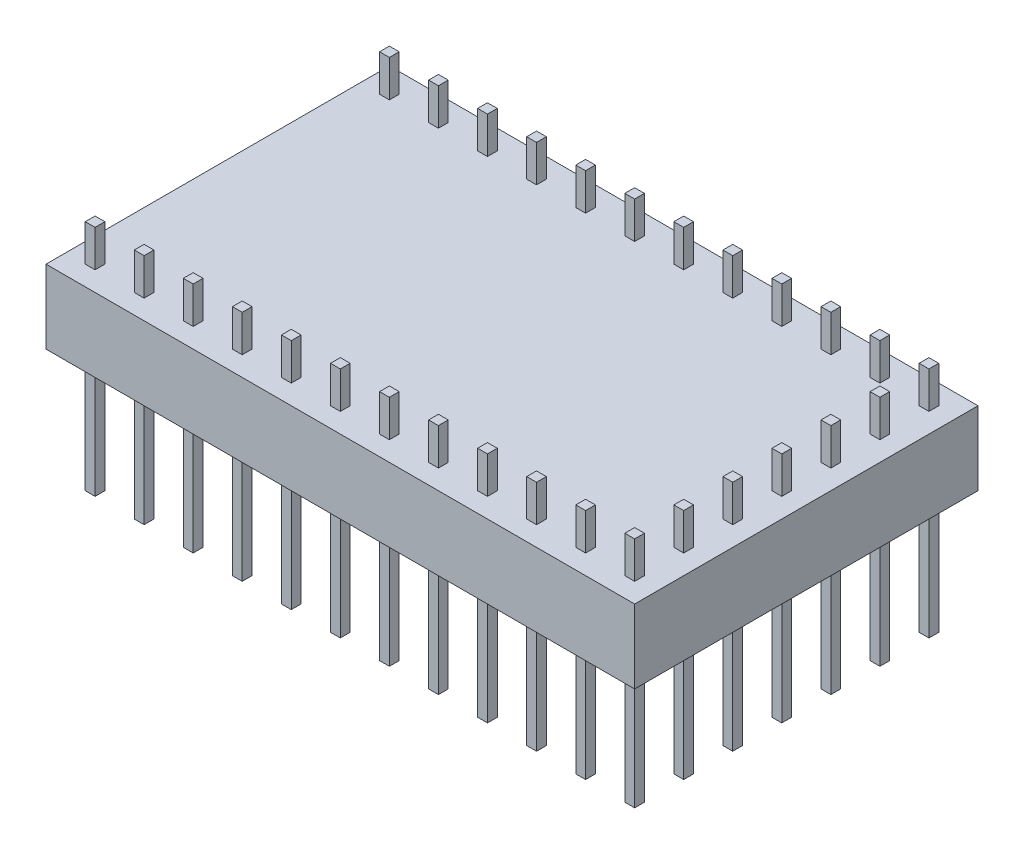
from build123d import *

# Parameters (mm, degrees)
SKETCH1_W                = 30.48
SKETCH1_H                = 17.78
BOSS_EXTRUDE1_DEPTH      = 3.81
BOSS_EXTRUDE2_DEPTH      = 1.905
BOSS_EXTRUDE2_DEPTH_BACK = 10.16
SKETCH2_W                = 0.508
SKETCH2_H                = 0.508


with BuildPart() as part:
    # Sketch1 → Boss-Extrude1 (new body)
    with BuildSketch(Plane(origin=(0, 0, 0), x_dir=(1, 0, 0), z_dir=(0, 1, 0))):
        Rectangle(SKETCH1_W, SKETCH1_H)
    extrude(amount=BOSS_EXTRUDE1_DEPTH)

    # Sketch2 → Boss-Extrude2 (add, two sides: drawn at the far end of the back side and taken through both)
    with BuildSketch(Plane(origin=(0, 3.81, 0), x_dir=(1, 0, 0), z_dir=(0, 1, 0)).offset(-BOSS_EXTRUDE2_DEPTH_BACK)):
        with Locations((-11.43, 7.62)):
            Rectangle(SKETCH2_W, SKETCH2_H)
        with Locations((-13.97, 7.62)):
            Rectangle(SKETCH2_W, SKETCH2_H)
        with Locations((-8.89, 7.62)):
            Rectangle(SKETCH2_W, SKETCH2_H)
        with Locations((-6.35, 7.62)):
            Rectangle(SKETCH2_W, SKETCH2_H)
        with Locations((-3.81, 7.62)):
            Rectangle(SKETCH2_W, SKETCH2_H)
        with Locations((-1.27, 7.62)):
            Rectangle(SKETCH2_W, SKETCH2_H)
        with Locations((1.27, 7.62)):
            Rectangle(SKETCH2_W, SKETCH2_H)
        with Locations((3.81, 7.62)):
            Rectangle(SKETCH2_W, SKETCH2_H)
        with Locations((6.35, 7.62)):
            Rectangle(SKETCH2_W, SKETCH2_H)
        with Locations((8.89, 7.62)):
            Rectangle(SKETCH2_W, SKETCH2_H)
        with Locations((11.43, 7.62)):
            Rectangle(SKETCH2_W, SKETCH2_H)
        with Locations((13.97, 7.62)):
            Rectangle(SKETCH2_W, SKETCH2_H)
        with Locations((13.97, -7.62)):
            Rectangle(SKETCH2_W, SKETCH2_H)
        with Locations((11.43, -7.62)):
            Rectangle(SKETCH2_W, SKETCH2_H)
        with Locations((8.89, -7.62)):
            Rectangle(SKETCH2_W, SKETCH2_H)
        with Locations((6.35, -7.62)):
            Rectangle(SKETCH2_W, SKETCH2_H)
        with Locations((3.81, -7.62)):
            Rectangle(SKETCH2_W, SKETCH2_H)
        with Locations((1.27, -7.62)):
            Rectangle(SKETCH2_W, SKETCH2_H)
        with Locations((-1.27, -7.62)):
            Rectangle(SKETCH2_W, SKETCH2_H)
        with Locations((-3.81, -7.62)):
            Rectangle(SKETCH2_W, SKETCH2_H)
        with Locations((-6.35, -7.62)):
            Rectangle(SKETCH2_W, SKETCH2_H)
        with Locations((-8.89, -7.62)):
            Rectangle(SKETCH2_W, SKETCH2_H)
        with Locations((-11.43, -7.62)):
            Rectangle(SKETCH2_W, SKETCH2_H)
        with Locations((-13.97, -7.62)):
            Rectangle(SKETCH2_W, SKETCH2_H)
        with Locations((13.97, 5.08)):
            Rectangle(SKETCH2_W, SKETCH2_H)
        with Locations((13.97, 2.54)):
            Rectangle(SKETCH2_W, SKETCH2_H)
        with Locations((13.97, 0)):
            Rectangle(SKETCH2_W, SKETCH2_H)
        with Locations((13.97, -2.54)):
            Rectangle(SKETCH2_W, SKETCH2_H)
        with Locations((13.97, -5.08)):
            Rectangle(SKETCH2_W, SKETCH2_H)
    extrude(amount=BOSS_EXTRUDE2_DEPTH + BOSS_EXTRUDE2_DEPTH_BACK)


solid = part.part
